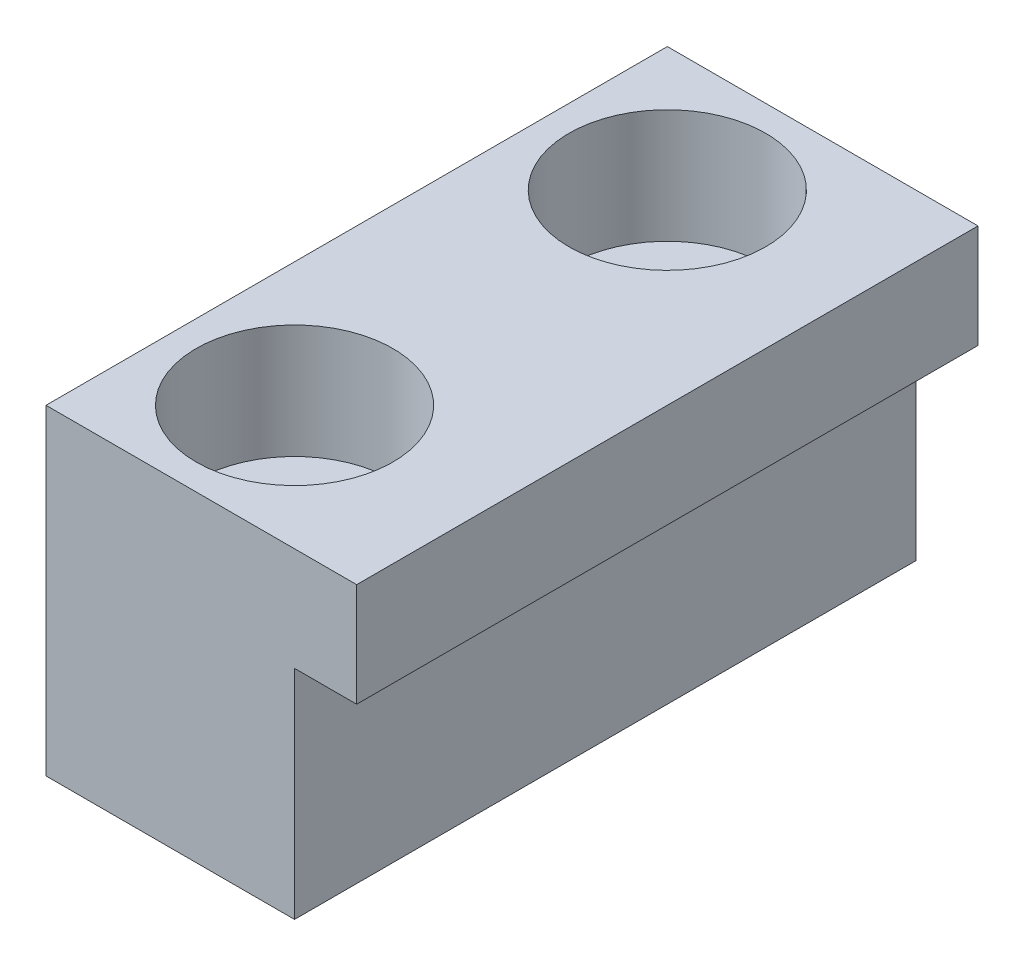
from build123d import *

# Parameters (mm, degrees)
EXTRUDE_1_DEPTH     = 30
SKETCH_2_R          = 2.75
CUT_EXTRUDE_1_DEPTH = 30
SKETCH_3_R          = 4.75
CUT_EXTRUDE_2_DEPTH = 5.5


with BuildPart() as part:
    # Sketch 1 → Extrude 1 (new body)
    with BuildSketch(Plane.XY):
        Polygon((0, 0), (12, 0), (12, 10.5), (15, 10.5), (15, 15.5), (0, 15.5), align=None)
    extrude(amount=EXTRUDE_1_DEPTH)

    # Sketch 2 → Cut-Extrude 1 (cut)
    with BuildSketch(Plane(origin=(0, 15.5, 0), x_dir=(1, 0, 0), z_dir=(0, 1, 0))):
        with Locations(Location((6, -6, 0), (0, 0, 270))):
            Circle(SKETCH_2_R)
        with Locations(Location((6, -24, 0), (0, 0, 270))):
            Circle(SKETCH_2_R)
    extrude(amount=-CUT_EXTRUDE_1_DEPTH, mode=Mode.SUBTRACT)

    # Sketch 3 → Cut-Extrude 2 (cut)
    with BuildSketch(Plane(origin=(0, 15.5, 0), x_dir=(1, 0, 0), z_dir=(0, 1, 0))):
        with Locations(Location((6, -6, 0), (0, 0, 270))):
            Circle(SKETCH_3_R)
        with Locations(Location((6, -24, 0), (0, 0, 270))):
            Circle(SKETCH_3_R)
    extrude(amount=-CUT_EXTRUDE_2_DEPTH, mode=Mode.SUBTRACT)


solid = part.part
